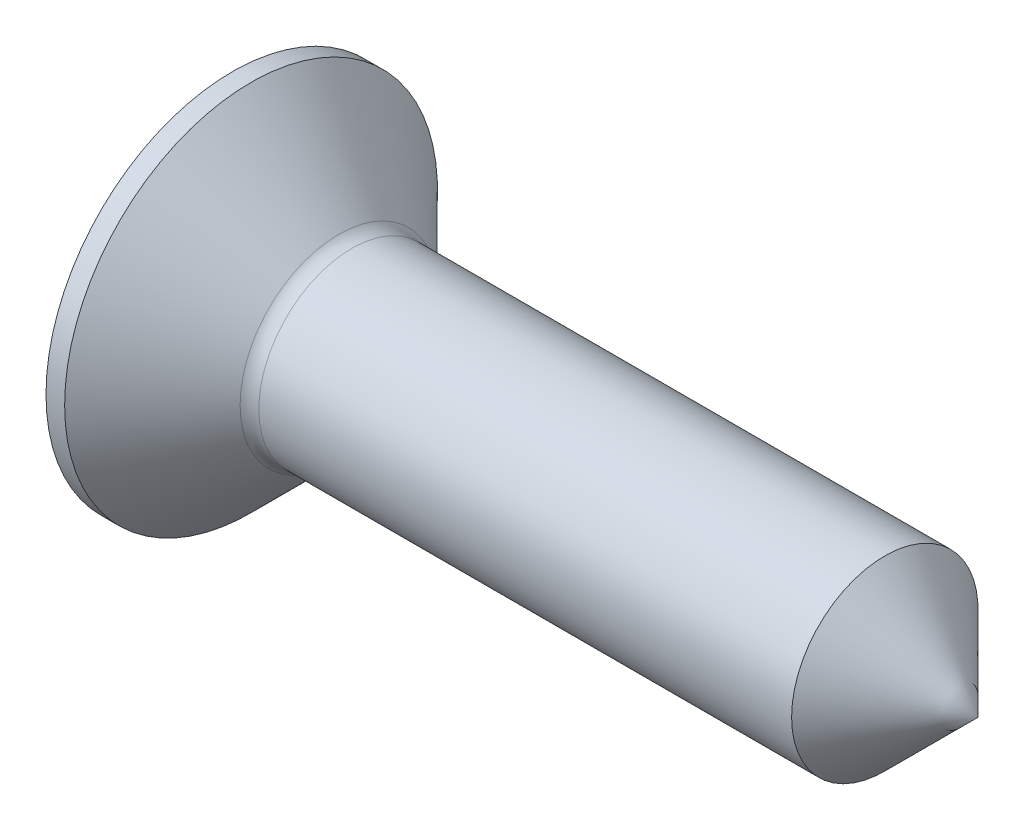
ISO-10303-21;
HEADER;
FILE_DESCRIPTION(('STEP AP214'),'2;1');
FILE_NAME('part.step','',(''),(''),'','','');
FILE_SCHEMA(('AUTOMOTIVE_DESIGN { 1 0 10303 214 1 1 1 1 }'));
ENDSEC;
DATA;
#1=APPLICATION_CONTEXT('core data for automotive mechanical design processes');
#2=APPLICATION_PROTOCOL_DEFINITION('international standard','automotive_design',2000,#1);
#3=PRODUCT_CONTEXT('',#1,'mechanical');
#4=PRODUCT('Part','Part','',(#3));
#5=PRODUCT_RELATED_PRODUCT_CATEGORY('part','',(#4));
#6=PRODUCT_DEFINITION_FORMATION('','',#4);
#7=PRODUCT_DEFINITION_CONTEXT('part definition',#1,'design');
#8=PRODUCT_DEFINITION('design','',#6,#7);
#9=PRODUCT_DEFINITION_SHAPE('','',#8);
#10=(LENGTH_UNIT() NAMED_UNIT(*) SI_UNIT(.MILLI.,.METRE.));
#11=(NAMED_UNIT(*) PLANE_ANGLE_UNIT() SI_UNIT($,.RADIAN.));
#12=(NAMED_UNIT(*) SI_UNIT($,.STERADIAN.) SOLID_ANGLE_UNIT());
#13=UNCERTAINTY_MEASURE_WITH_UNIT(LENGTH_MEASURE(1.E-05),#10,'distance_accuracy_value','');
#14=(GEOMETRIC_REPRESENTATION_CONTEXT(3) GLOBAL_UNCERTAINTY_ASSIGNED_CONTEXT((#13)) GLOBAL_UNIT_ASSIGNED_CONTEXT((#10,
#11,#12)) REPRESENTATION_CONTEXT('',''));
#15=CARTESIAN_POINT('',(0.,0.,0.));
#16=DIRECTION('',(0.,0.,1.));
#17=DIRECTION('',(1.,0.,0.));
#18=AXIS2_PLACEMENT_3D('',#15,#16,#17);
#19=CARTESIAN_POINT('',(-6.50645201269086,0.,0.));
#20=DIRECTION('',(-1.,0.,0.));
#21=DIRECTION('',(0.,0.,1.));
#22=AXIS2_PLACEMENT_3D('',#19,#20,#21);
#23=CYLINDRICAL_SURFACE('',#22,1.);
#24=CARTESIAN_POINT('',(1.28284271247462,0.,0.));
#25=DIRECTION('',(-1.,0.,0.));
#26=DIRECTION('',(0.,0.,1.));
#27=AXIS2_PLACEMENT_3D('',#24,#25,#26);
#28=CIRCLE('',#27,1.);
#29=CARTESIAN_POINT('',(1.28284271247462,0.,1.));
#30=VERTEX_POINT('',#29);
#31=EDGE_CURVE('E12',#30,#30,#28,.F.);
#32=ORIENTED_EDGE('',*,*,#31,.T.);
#33=EDGE_LOOP('',(#32));
#34=FACE_BOUND('',#33,.T.);
#35=CARTESIAN_POINT('',(7.,0.,0.));
#36=DIRECTION('',(-1.,0.,0.));
#37=DIRECTION('',(0.,0.,1.));
#38=AXIS2_PLACEMENT_3D('',#35,#36,#37);
#39=CIRCLE('',#38,1.);
#40=CARTESIAN_POINT('',(7.,0.,1.));
#41=VERTEX_POINT('',#40);
#42=EDGE_CURVE('E128',#41,#41,#39,.F.);
#43=ORIENTED_EDGE('',*,*,#42,.F.);
#44=EDGE_LOOP('',(#43));
#45=FACE_BOUND('',#44,.T.);
#46=ADVANCED_FACE('F49',(#34,#45),#23,.T.);
#47=CARTESIAN_POINT('',(1.2,0.,0.));
#48=DIRECTION('',(-1.,0.,0.));
#49=DIRECTION('',(0.,0.,1.));
#50=AXIS2_PLACEMENT_3D('',#47,#48,#49);
#51=CONICAL_SURFACE('',#50,0.999999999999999,0.785398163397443);
#52=CARTESIAN_POINT('',(1.14142135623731,0.,0.));
#53=DIRECTION('',(-1.,0.,0.));
#54=DIRECTION('',(0.,0.,1.));
#55=AXIS2_PLACEMENT_3D('',#52,#53,#54);
#56=CIRCLE('',#55,1.05857864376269);
#57=CARTESIAN_POINT('',(1.14142135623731,0.,1.05857864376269));
#58=VERTEX_POINT('',#57);
#59=EDGE_CURVE('E58',#58,#58,#56,.T.);
#60=ORIENTED_EDGE('',*,*,#59,.T.);
#61=EDGE_LOOP('',(#60));
#62=FACE_BOUND('',#61,.T.);
#63=CARTESIAN_POINT('',(0.199999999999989,0.,0.));
#64=DIRECTION('',(-1.,0.,0.));
#65=DIRECTION('',(0.,0.,1.));
#66=AXIS2_PLACEMENT_3D('',#63,#64,#65);
#67=CIRCLE('',#66,2.);
#68=CARTESIAN_POINT('',(0.199999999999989,0.,2.));
#69=VERTEX_POINT('',#68);
#70=EDGE_CURVE('E481',#69,#69,#67,.T.);
#71=ORIENTED_EDGE('',*,*,#70,.F.);
#72=EDGE_LOOP('',(#71));
#73=FACE_BOUND('',#72,.T.);
#74=ADVANCED_FACE('F281',(#62,#73),#51,.T.);
#75=CARTESIAN_POINT('',(-6.50645201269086,0.,0.));
#76=DIRECTION('',(-1.,0.,0.));
#77=DIRECTION('',(0.,0.,1.));
#78=AXIS2_PLACEMENT_3D('',#75,#76,#77);
#79=CYLINDRICAL_SURFACE('',#78,2.);
#80=CARTESIAN_POINT('',(0.,0.,0.));
#81=DIRECTION('',(-1.,0.,0.));
#82=DIRECTION('',(0.,0.,1.));
#83=AXIS2_PLACEMENT_3D('',#80,#81,#82);
#84=CIRCLE('',#83,2.);
#85=CARTESIAN_POINT('',(0.,0.,2.));
#86=VERTEX_POINT('',#85);
#87=EDGE_CURVE('E131',#86,#86,#84,.T.);
#88=ORIENTED_EDGE('',*,*,#87,.F.);
#89=EDGE_LOOP('',(#88));
#90=FACE_BOUND('',#89,.T.);
#91=ORIENTED_EDGE('',*,*,#70,.T.);
#92=EDGE_LOOP('',(#91));
#93=FACE_BOUND('',#92,.T.);
#94=ADVANCED_FACE('F286',(#90,#93),#79,.T.);
#95=CARTESIAN_POINT('',(0.,0.,-2.));
#96=DIRECTION('',(1.,0.,0.));
#97=DIRECTION('',(0.,0.,-1.));
#98=AXIS2_PLACEMENT_3D('',#95,#96,#97);
#99=PLANE('',#98);
#100=DIRECTION('',(0.,0.,-1.));
#101=VECTOR('',#100,1.);
#102=CARTESIAN_POINT('',(0.,0.25,-0.25));
#103=LINE('',#102,#101);
#104=CARTESIAN_POINT('',(0.,0.25,-0.25));
#105=VERTEX_POINT('',#104);
#106=CARTESIAN_POINT('',(0.,0.25,-1.25));
#107=VERTEX_POINT('',#106);
#108=EDGE_CURVE('E110',#105,#107,#103,.T.);
#109=ORIENTED_EDGE('',*,*,#108,.F.);
#110=DIRECTION('',(0.,-1.,0.));
#111=VECTOR('',#110,1.);
#112=CARTESIAN_POINT('',(0.,0.25,-0.25));
#113=LINE('',#112,#111);
#114=CARTESIAN_POINT('',(0.,1.25,-0.25));
#115=VERTEX_POINT('',#114);
#116=EDGE_CURVE('E115',#115,#105,#113,.T.);
#117=ORIENTED_EDGE('',*,*,#116,.F.);
#118=DIRECTION('',(0.,0.,-1.));
#119=VECTOR('',#118,1.);
#120=CARTESIAN_POINT('',(0.,1.25,0.25));
#121=LINE('',#120,#119);
#122=CARTESIAN_POINT('',(0.,1.25,0.25));
#123=VERTEX_POINT('',#122);
#124=EDGE_CURVE('E122',#123,#115,#121,.T.);
#125=ORIENTED_EDGE('',*,*,#124,.F.);
#126=DIRECTION('',(0.,1.,0.));
#127=VECTOR('',#126,1.);
#128=CARTESIAN_POINT('',(0.,0.250000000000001,0.25));
#129=LINE('',#128,#127);
#130=CARTESIAN_POINT('',(0.,0.250000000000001,0.25));
#131=VERTEX_POINT('',#130);
#132=EDGE_CURVE('E172',#131,#123,#129,.T.);
#133=ORIENTED_EDGE('',*,*,#132,.F.);
#134=DIRECTION('',(0.,0.,-1.));
#135=VECTOR('',#134,1.);
#136=CARTESIAN_POINT('',(0.,0.250000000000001,1.25));
#137=LINE('',#136,#135);
#138=CARTESIAN_POINT('',(0.,0.250000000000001,1.25));
#139=VERTEX_POINT('',#138);
#140=EDGE_CURVE('E170',#139,#131,#137,.T.);
#141=ORIENTED_EDGE('',*,*,#140,.F.);
#142=DIRECTION('',(0.,1.,0.));
#143=VECTOR('',#142,1.);
#144=CARTESIAN_POINT('',(0.,0.250000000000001,1.25));
#145=LINE('',#144,#143);
#146=CARTESIAN_POINT('',(0.,-0.25,1.25));
#147=VERTEX_POINT('',#146);
#148=EDGE_CURVE('E166',#147,#139,#145,.T.);
#149=ORIENTED_EDGE('',*,*,#148,.F.);
#150=DIRECTION('',(0.,0.,1.));
#151=VECTOR('',#150,1.);
#152=CARTESIAN_POINT('',(0.,-0.25,1.25));
#153=LINE('',#152,#151);
#154=CARTESIAN_POINT('',(0.,-0.249999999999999,0.250000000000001));
#155=VERTEX_POINT('',#154);
#156=EDGE_CURVE('E162',#155,#147,#153,.T.);
#157=ORIENTED_EDGE('',*,*,#156,.F.);
#158=DIRECTION('',(0.,1.,0.));
#159=VECTOR('',#158,1.);
#160=CARTESIAN_POINT('',(0.,-1.25,0.250000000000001));
#161=LINE('',#160,#159);
#162=CARTESIAN_POINT('',(0.,-1.25,0.250000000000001));
#163=VERTEX_POINT('',#162);
#164=EDGE_CURVE('E158',#163,#155,#161,.T.);
#165=ORIENTED_EDGE('',*,*,#164,.F.);
#166=DIRECTION('',(0.,0.,1.));
#167=VECTOR('',#166,1.);
#168=CARTESIAN_POINT('',(0.,-1.25,0.250000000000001));
#169=LINE('',#168,#167);
#170=CARTESIAN_POINT('',(0.,-1.25,-0.25));
#171=VERTEX_POINT('',#170);
#172=EDGE_CURVE('E154',#171,#163,#169,.T.);
#173=ORIENTED_EDGE('',*,*,#172,.F.);
#174=DIRECTION('',(0.,-1.,0.));
#175=VECTOR('',#174,1.);
#176=CARTESIAN_POINT('',(0.,-1.25,-0.25));
#177=LINE('',#176,#175);
#178=CARTESIAN_POINT('',(0.,-0.25,-0.25));
#179=VERTEX_POINT('',#178);
#180=EDGE_CURVE('E157',#179,#171,#177,.T.);
#181=ORIENTED_EDGE('',*,*,#180,.F.);
#182=DIRECTION('',(0.,0.,1.));
#183=VECTOR('',#182,1.);
#184=CARTESIAN_POINT('',(0.,-0.25,-0.25));
#185=LINE('',#184,#183);
#186=CARTESIAN_POINT('',(0.,-0.25,-1.25));
#187=VERTEX_POINT('',#186);
#188=EDGE_CURVE('E133',#187,#179,#185,.T.);
#189=ORIENTED_EDGE('',*,*,#188,.F.);
#190=DIRECTION('',(0.,-1.,0.));
#191=VECTOR('',#190,1.);
#192=CARTESIAN_POINT('',(0.,0.25,-1.25));
#193=LINE('',#192,#191);
#194=EDGE_CURVE('E126',#107,#187,#193,.T.);
#195=ORIENTED_EDGE('',*,*,#194,.F.);
#196=EDGE_LOOP('',(#109,#117,#125,#133,#141,#149,#157,#165,#173,#181,#189,#195));
#197=FACE_BOUND('',#196,.T.);
#198=ORIENTED_EDGE('',*,*,#87,.T.);
#199=EDGE_LOOP('',(#198));
#200=FACE_BOUND('',#199,.T.);
#201=ADVANCED_FACE('F123',(#197,#200),#99,.F.);
#202=CARTESIAN_POINT('',(-11.9999999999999,0.,0.));
#203=DIRECTION('',(-1.,0.,0.));
#204=DIRECTION('',(0.,0.,1.));
#205=AXIS2_PLACEMENT_3D('',#202,#203,#204);
#206=CONICAL_SURFACE('',#205,20.,0.78539816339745);
#207=CARTESIAN_POINT('',(8.,0.,0.));
#208=VERTEX_POINT('',#207);
#209=VERTEX_LOOP('',#208);
#210=FACE_BOUND('',#209,.T.);
#211=ORIENTED_EDGE('',*,*,#42,.T.);
#212=EDGE_LOOP('',(#211));
#213=FACE_BOUND('',#212,.T.);
#214=ADVANCED_FACE('F276',(#210,#213),#206,.T.);
#215=CARTESIAN_POINT('',(1.28284271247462,0.,0.));
#216=DIRECTION('',(-1.,0.,0.));
#217=DIRECTION('',(0.,0.,1.));
#218=AXIS2_PLACEMENT_3D('',#215,#216,#217);
#219=TOROIDAL_SURFACE('',#218,1.2,0.2);
#220=ORIENTED_EDGE('',*,*,#31,.F.);
#221=EDGE_LOOP('',(#220));
#222=FACE_BOUND('',#221,.T.);
#223=ORIENTED_EDGE('',*,*,#59,.F.);
#224=EDGE_LOOP('',(#223));
#225=FACE_BOUND('',#224,.T.);
#226=ADVANCED_FACE('F51',(#222,#225),#219,.F.);
#227=CARTESIAN_POINT('',(0.,1.25,-0.25));
#228=DIRECTION('',(0.169906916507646,0.,-0.985460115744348));
#229=DIRECTION('',(-0.985460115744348,0.,-0.169906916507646));
#230=AXIS2_PLACEMENT_3D('',#227,#228,#229);
#231=PLANE('',#230);
#232=DIRECTION('',(0.751033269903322,-0.647442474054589,0.129488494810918));
#233=VECTOR('',#232,1.);
#234=CARTESIAN_POINT('',(0.,1.25,-0.25));
#235=LINE('',#234,#233);
#236=CARTESIAN_POINT('',(1.45,0.,0.));
#237=VERTEX_POINT('',#236);
#238=EDGE_CURVE('E116',#115,#237,#235,.T.);
#239=ORIENTED_EDGE('',*,*,#238,.F.);
#240=ORIENTED_EDGE('',*,*,#116,.T.);
#241=DIRECTION('',(0.971536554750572,-0.167506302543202,0.167506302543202));
#242=VECTOR('',#241,1.);
#243=CARTESIAN_POINT('',(0.,0.25,-0.25));
#244=LINE('',#243,#242);
#245=EDGE_CURVE('E106',#105,#237,#244,.T.);
#246=ORIENTED_EDGE('',*,*,#245,.T.);
#247=EDGE_LOOP('',(#239,#240,#246));
#248=FACE_BOUND('',#247,.T.);
#249=ADVANCED_FACE('F119',(#248),#231,.F.);
#250=CARTESIAN_POINT('',(0.,0.25,-0.25));
#251=DIRECTION('',(0.169906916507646,0.985460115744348,0.));
#252=DIRECTION('',(-0.985460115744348,0.169906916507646,0.));
#253=AXIS2_PLACEMENT_3D('',#250,#251,#252);
#254=PLANE('',#253);
#255=ORIENTED_EDGE('',*,*,#245,.F.);
#256=ORIENTED_EDGE('',*,*,#108,.T.);
#257=DIRECTION('',(0.751033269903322,-0.129488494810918,0.647442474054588));
#258=VECTOR('',#257,1.);
#259=CARTESIAN_POINT('',(0.,0.25,-1.25));
#260=LINE('',#259,#258);
#261=EDGE_CURVE('E66',#107,#237,#260,.T.);
#262=ORIENTED_EDGE('',*,*,#261,.T.);
#263=EDGE_LOOP('',(#255,#256,#262));
#264=FACE_BOUND('',#263,.T.);
#265=ADVANCED_FACE('F108',(#264),#254,.F.);
#266=CARTESIAN_POINT('',(0.,1.25,0.25));
#267=DIRECTION('',(0.652939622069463,0.757409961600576,0.));
#268=DIRECTION('',(-0.757409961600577,0.652939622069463,0.));
#269=AXIS2_PLACEMENT_3D('',#266,#267,#268);
#270=PLANE('',#269);
#271=DIRECTION('',(0.751033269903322,-0.647442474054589,-0.129488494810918));
#272=VECTOR('',#271,1.);
#273=CARTESIAN_POINT('',(0.,1.25,0.25));
#274=LINE('',#273,#272);
#275=EDGE_CURVE('E182',#123,#237,#274,.T.);
#276=ORIENTED_EDGE('',*,*,#275,.F.);
#277=ORIENTED_EDGE('',*,*,#124,.T.);
#278=ORIENTED_EDGE('',*,*,#238,.T.);
#279=EDGE_LOOP('',(#276,#277,#278));
#280=FACE_BOUND('',#279,.T.);
#281=ADVANCED_FACE('F181',(#280),#270,.F.);
#282=CARTESIAN_POINT('',(0.,0.250000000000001,0.25));
#283=DIRECTION('',(0.169906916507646,0.,0.985460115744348));
#284=DIRECTION('',(0.985460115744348,0.,-0.169906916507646));
#285=AXIS2_PLACEMENT_3D('',#282,#283,#284);
#286=PLANE('',#285);
#287=DIRECTION('',(0.971536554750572,-0.167506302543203,-0.167506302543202));
#288=VECTOR('',#287,1.);
#289=CARTESIAN_POINT('',(0.,0.250000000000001,0.25));
#290=LINE('',#289,#288);
#291=EDGE_CURVE('E333',#131,#237,#290,.T.);
#292=ORIENTED_EDGE('',*,*,#291,.F.);
#293=ORIENTED_EDGE('',*,*,#132,.T.);
#294=ORIENTED_EDGE('',*,*,#275,.T.);
#295=EDGE_LOOP('',(#292,#293,#294));
#296=FACE_BOUND('',#295,.T.);
#297=ADVANCED_FACE('F202',(#296),#286,.F.);
#298=CARTESIAN_POINT('',(0.,0.250000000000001,1.25));
#299=DIRECTION('',(0.169906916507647,0.985460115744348,0.));
#300=DIRECTION('',(-0.985460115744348,0.169906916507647,0.));
#301=AXIS2_PLACEMENT_3D('',#298,#299,#300);
#302=PLANE('',#301);
#303=DIRECTION('',(0.751033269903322,-0.129488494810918,-0.647442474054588));
#304=VECTOR('',#303,1.);
#305=CARTESIAN_POINT('',(0.,0.250000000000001,1.25));
#306=LINE('',#305,#304);
#307=EDGE_CURVE('E231',#139,#237,#306,.T.);
#308=ORIENTED_EDGE('',*,*,#307,.F.);
#309=ORIENTED_EDGE('',*,*,#140,.T.);
#310=ORIENTED_EDGE('',*,*,#291,.T.);
#311=EDGE_LOOP('',(#308,#309,#310));
#312=FACE_BOUND('',#311,.T.);
#313=ADVANCED_FACE('F206',(#312),#302,.F.);
#314=CARTESIAN_POINT('',(0.,-0.25,1.25));
#315=DIRECTION('',(0.652939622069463,0.,0.757409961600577));
#316=DIRECTION('',(0.757409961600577,0.,-0.652939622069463));
#317=AXIS2_PLACEMENT_3D('',#314,#315,#316);
#318=PLANE('',#317);
#319=DIRECTION('',(0.751033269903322,0.129488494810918,-0.647442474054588));
#320=VECTOR('',#319,1.);
#321=CARTESIAN_POINT('',(0.,-0.25,1.25));
#322=LINE('',#321,#320);
#323=EDGE_CURVE('E223',#147,#237,#322,.T.);
#324=ORIENTED_EDGE('',*,*,#323,.F.);
#325=ORIENTED_EDGE('',*,*,#148,.T.);
#326=ORIENTED_EDGE('',*,*,#307,.T.);
#327=EDGE_LOOP('',(#324,#325,#326));
#328=FACE_BOUND('',#327,.T.);
#329=ADVANCED_FACE('F209',(#328),#318,.F.);
#330=CARTESIAN_POINT('',(0.,-0.249999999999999,0.25));
#331=DIRECTION('',(0.169906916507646,-0.985460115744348,0.));
#332=DIRECTION('',(0.985460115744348,0.169906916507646,0.));
#333=AXIS2_PLACEMENT_3D('',#330,#331,#332);
#334=PLANE('',#333);
#335=DIRECTION('',(0.971536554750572,0.167506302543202,-0.167506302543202));
#336=VECTOR('',#335,1.);
#337=CARTESIAN_POINT('',(0.,-0.249999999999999,0.250000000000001));
#338=LINE('',#337,#336);
#339=EDGE_CURVE('E232',#155,#237,#338,.T.);
#340=ORIENTED_EDGE('',*,*,#339,.F.);
#341=ORIENTED_EDGE('',*,*,#156,.T.);
#342=ORIENTED_EDGE('',*,*,#323,.T.);
#343=EDGE_LOOP('',(#340,#341,#342));
#344=FACE_BOUND('',#343,.T.);
#345=ADVANCED_FACE('F214',(#344),#334,.F.);
#346=CARTESIAN_POINT('',(0.,-1.25,0.250000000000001));
#347=DIRECTION('',(0.169906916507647,0.,0.985460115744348));
#348=DIRECTION('',(0.985460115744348,0.,-0.169906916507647));
#349=AXIS2_PLACEMENT_3D('',#346,#347,#348);
#350=PLANE('',#349);
#351=DIRECTION('',(0.751033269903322,0.647442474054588,-0.129488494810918));
#352=VECTOR('',#351,1.);
#353=CARTESIAN_POINT('',(0.,-1.25,0.250000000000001));
#354=LINE('',#353,#352);
#355=EDGE_CURVE('E237',#163,#237,#354,.T.);
#356=ORIENTED_EDGE('',*,*,#355,.F.);
#357=ORIENTED_EDGE('',*,*,#164,.T.);
#358=ORIENTED_EDGE('',*,*,#339,.T.);
#359=EDGE_LOOP('',(#356,#357,#358));
#360=FACE_BOUND('',#359,.T.);
#361=ADVANCED_FACE('F265',(#360),#350,.F.);
#362=CARTESIAN_POINT('',(0.,-1.25,-0.25));
#363=DIRECTION('',(0.652939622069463,-0.757409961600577,0.));
#364=DIRECTION('',(0.757409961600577,0.652939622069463,0.));
#365=AXIS2_PLACEMENT_3D('',#362,#363,#364);
#366=PLANE('',#365);
#367=DIRECTION('',(0.751033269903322,0.647442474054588,0.129488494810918));
#368=VECTOR('',#367,1.);
#369=CARTESIAN_POINT('',(0.,-1.25,-0.25));
#370=LINE('',#369,#368);
#371=EDGE_CURVE('E242',#171,#237,#370,.T.);
#372=ORIENTED_EDGE('',*,*,#371,.F.);
#373=ORIENTED_EDGE('',*,*,#172,.T.);
#374=ORIENTED_EDGE('',*,*,#355,.T.);
#375=EDGE_LOOP('',(#372,#373,#374));
#376=FACE_BOUND('',#375,.T.);
#377=ADVANCED_FACE('F255',(#376),#366,.F.);
#378=CARTESIAN_POINT('',(0.,-0.25,-0.25));
#379=DIRECTION('',(0.169906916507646,0.,-0.985460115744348));
#380=DIRECTION('',(-0.985460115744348,0.,-0.169906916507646));
#381=AXIS2_PLACEMENT_3D('',#378,#379,#380);
#382=PLANE('',#381);
#383=DIRECTION('',(0.971536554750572,0.167506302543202,0.167506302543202));
#384=VECTOR('',#383,1.);
#385=CARTESIAN_POINT('',(0.,-0.25,-0.25));
#386=LINE('',#385,#384);
#387=EDGE_CURVE('E322',#179,#237,#386,.T.);
#388=ORIENTED_EDGE('',*,*,#387,.F.);
#389=ORIENTED_EDGE('',*,*,#180,.T.);
#390=ORIENTED_EDGE('',*,*,#371,.T.);
#391=EDGE_LOOP('',(#388,#389,#390));
#392=FACE_BOUND('',#391,.T.);
#393=ADVANCED_FACE('F264',(#392),#382,.F.);
#394=CARTESIAN_POINT('',(0.,-0.25,-1.25));
#395=DIRECTION('',(0.169906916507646,-0.985460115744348,0.));
#396=DIRECTION('',(0.985460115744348,0.169906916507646,0.));
#397=AXIS2_PLACEMENT_3D('',#394,#395,#396);
#398=PLANE('',#397);
#399=DIRECTION('',(0.751033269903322,0.129488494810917,0.647442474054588));
#400=VECTOR('',#399,1.);
#401=CARTESIAN_POINT('',(0.,-0.25,-1.25));
#402=LINE('',#401,#400);
#403=EDGE_CURVE('E344',#187,#237,#402,.T.);
#404=ORIENTED_EDGE('',*,*,#403,.F.);
#405=ORIENTED_EDGE('',*,*,#188,.T.);
#406=ORIENTED_EDGE('',*,*,#387,.T.);
#407=EDGE_LOOP('',(#404,#405,#406));
#408=FACE_BOUND('',#407,.T.);
#409=ADVANCED_FACE('F268',(#408),#398,.F.);
#410=CARTESIAN_POINT('',(0.,0.25,-1.25));
#411=DIRECTION('',(0.652939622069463,0.,-0.757409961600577));
#412=DIRECTION('',(-0.757409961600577,0.,-0.652939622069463));
#413=AXIS2_PLACEMENT_3D('',#410,#411,#412);
#414=PLANE('',#413);
#415=ORIENTED_EDGE('',*,*,#261,.F.);
#416=ORIENTED_EDGE('',*,*,#194,.T.);
#417=ORIENTED_EDGE('',*,*,#403,.T.);
#418=EDGE_LOOP('',(#415,#416,#417));
#419=FACE_BOUND('',#418,.T.);
#420=ADVANCED_FACE('F271',(#419),#414,.F.);
#421=CLOSED_SHELL('',(#46,#74,#94,#201,#214,#226,#249,#265,#281,#297,#313,#329,#345,#361,#377,
#393,#409,#420));
#422=MANIFOLD_SOLID_BREP('B2',#421);
#423=ADVANCED_BREP_SHAPE_REPRESENTATION('',(#18,#422),#14);
#424=SHAPE_DEFINITION_REPRESENTATION(#9,#423);
ENDSEC;
END-ISO-10303-21;
